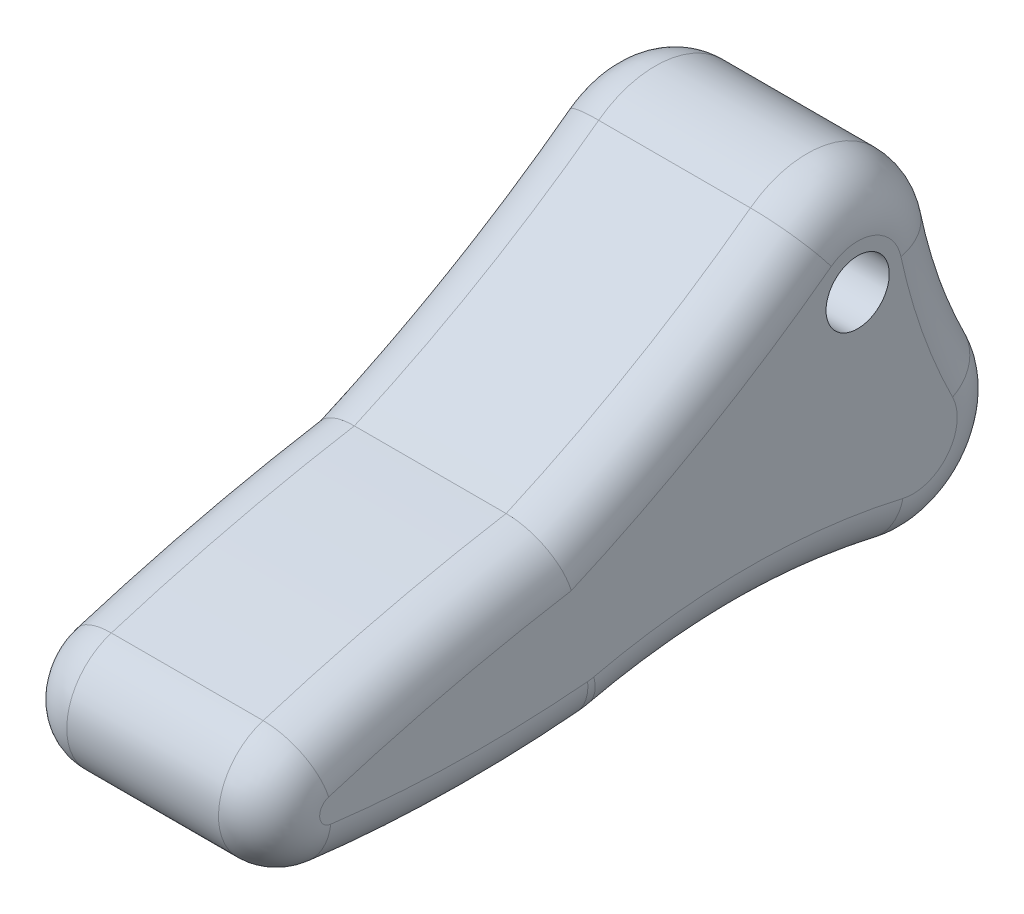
ISO-10303-21;
HEADER;
FILE_DESCRIPTION(('STEP AP214'),'2;1');
FILE_NAME('part.step','',(''),(''),'','','');
FILE_SCHEMA(('AUTOMOTIVE_DESIGN { 1 0 10303 214 1 1 1 1 }'));
ENDSEC;
DATA;
#1=APPLICATION_CONTEXT('core data for automotive mechanical design processes');
#2=APPLICATION_PROTOCOL_DEFINITION('international standard','automotive_design',2000,#1);
#3=PRODUCT_CONTEXT('',#1,'mechanical');
#4=PRODUCT('Part','Part','',(#3));
#5=PRODUCT_RELATED_PRODUCT_CATEGORY('part','',(#4));
#6=PRODUCT_DEFINITION_FORMATION('','',#4);
#7=PRODUCT_DEFINITION_CONTEXT('part definition',#1,'design');
#8=PRODUCT_DEFINITION('design','',#6,#7);
#9=PRODUCT_DEFINITION_SHAPE('','',#8);
#10=(LENGTH_UNIT() NAMED_UNIT(*) SI_UNIT(.MILLI.,.METRE.));
#11=(NAMED_UNIT(*) PLANE_ANGLE_UNIT() SI_UNIT($,.RADIAN.));
#12=(NAMED_UNIT(*) SI_UNIT($,.STERADIAN.) SOLID_ANGLE_UNIT());
#13=UNCERTAINTY_MEASURE_WITH_UNIT(LENGTH_MEASURE(1.E-05),#10,'distance_accuracy_value','');
#14=(GEOMETRIC_REPRESENTATION_CONTEXT(3) GLOBAL_UNCERTAINTY_ASSIGNED_CONTEXT((#13)) GLOBAL_UNIT_ASSIGNED_CONTEXT((#10,
#11,#12)) REPRESENTATION_CONTEXT('',''));
#15=CARTESIAN_POINT('',(0.,0.,0.));
#16=DIRECTION('',(0.,0.,1.));
#17=DIRECTION('',(1.,0.,0.));
#18=AXIS2_PLACEMENT_3D('',#15,#16,#17);
#19=CARTESIAN_POINT('',(50.8,437.978347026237,326.190400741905));
#20=DIRECTION('',(-1.,0.,0.));
#21=DIRECTION('',(0.,0.,1.));
#22=AXIS2_PLACEMENT_3D('',#19,#20,#21);
#23=CYLINDRICAL_SURFACE('',#22,508.);
#24=DIRECTION('',(-1.,0.,0.));
#25=VECTOR('',#24,1.);
#26=CARTESIAN_POINT('',(0.,-26.6889113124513,120.889794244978));
#27=LINE('',#26,#25);
#28=CARTESIAN_POINT('',(30.48,-26.6889113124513,120.889794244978));
#29=VERTEX_POINT('',#28);
#30=CARTESIAN_POINT('',(-30.48,-26.6889113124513,120.889794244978));
#31=VERTEX_POINT('',#30);
#32=EDGE_CURVE('E345',#29,#31,#27,.T.);
#33=ORIENTED_EDGE('',*,*,#32,.F.);
#34=CARTESIAN_POINT('',(30.48,437.978347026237,326.190400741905));
#35=DIRECTION('',(-1.,0.,0.));
#36=DIRECTION('',(0.,0.,1.));
#37=AXIS2_PLACEMENT_3D('',#34,#35,#36);
#38=CIRCLE('',#37,508.);
#39=CARTESIAN_POINT('',(30.48,30.5566288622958,22.7574698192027));
#40=VERTEX_POINT('',#39);
#41=EDGE_CURVE('E220',#29,#40,#38,.F.);
#42=ORIENTED_EDGE('',*,*,#41,.T.);
#43=DIRECTION('',(-1.,0.,0.));
#44=VECTOR('',#43,1.);
#45=CARTESIAN_POINT('',(50.8,30.5566288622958,22.7574698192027));
#46=LINE('',#45,#44);
#47=CARTESIAN_POINT('',(-30.48,30.5566288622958,22.7574698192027));
#48=VERTEX_POINT('',#47);
#49=EDGE_CURVE('E357',#40,#48,#46,.T.);
#50=ORIENTED_EDGE('',*,*,#49,.T.);
#51=CARTESIAN_POINT('',(-30.48,437.978347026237,326.190400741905));
#52=DIRECTION('',(-1.,0.,0.));
#53=DIRECTION('',(0.,0.,1.));
#54=AXIS2_PLACEMENT_3D('',#51,#52,#53);
#55=CIRCLE('',#54,508.);
#56=EDGE_CURVE('E218',#48,#31,#55,.T.);
#57=ORIENTED_EDGE('',*,*,#56,.T.);
#58=EDGE_LOOP('',(#33,#42,#50,#57));
#59=FACE_BOUND('',#58,.T.);
#60=ADVANCED_FACE('F31',(#59),#23,.F.);
#61=CARTESIAN_POINT('',(50.8,55.6115098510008,-260.837593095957));
#62=DIRECTION('',(-1.,0.,0.));
#63=DIRECTION('',(0.,0.,1.));
#64=AXIS2_PLACEMENT_3D('',#61,#62,#63);
#65=CYLINDRICAL_SURFACE('',#64,228.6);
#66=DIRECTION('',(-1.,0.,0.));
#67=VECTOR('',#66,1.);
#68=CARTESIAN_POINT('',(50.8,7.94450140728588,-37.2625132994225));
#69=LINE('',#68,#67);
#70=CARTESIAN_POINT('',(30.48,7.94450140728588,-37.2625132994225));
#71=VERTEX_POINT('',#70);
#72=CARTESIAN_POINT('',(-30.48,7.94450140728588,-37.2625132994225));
#73=VERTEX_POINT('',#72);
#74=EDGE_CURVE('E175',#71,#73,#69,.T.);
#75=ORIENTED_EDGE('',*,*,#74,.F.);
#76=CARTESIAN_POINT('',(30.48,55.6115098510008,-260.837593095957));
#77=DIRECTION('',(-1.,0.,0.));
#78=DIRECTION('',(0.,0.,1.));
#79=AXIS2_PLACEMENT_3D('',#76,#77,#78);
#80=CIRCLE('',#79,228.6);
#81=CARTESIAN_POINT('',(30.48,-46.4840700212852,-56.3028709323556));
#82=VERTEX_POINT('',#81);
#83=EDGE_CURVE('E191',#71,#82,#80,.F.);
#84=ORIENTED_EDGE('',*,*,#83,.T.);
#85=DIRECTION('',(-1.,0.,0.));
#86=VECTOR('',#85,1.);
#87=CARTESIAN_POINT('',(50.8,-46.4840700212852,-56.3028709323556));
#88=LINE('',#87,#86);
#89=CARTESIAN_POINT('',(-30.48,-46.4840700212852,-56.3028709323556));
#90=VERTEX_POINT('',#89);
#91=EDGE_CURVE('E348',#82,#90,#88,.T.);
#92=ORIENTED_EDGE('',*,*,#91,.T.);
#93=CARTESIAN_POINT('',(-30.48,55.6115098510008,-260.837593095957));
#94=DIRECTION('',(-1.,0.,0.));
#95=DIRECTION('',(0.,0.,1.));
#96=AXIS2_PLACEMENT_3D('',#93,#94,#95);
#97=CIRCLE('',#96,228.6);
#98=EDGE_CURVE('E189',#90,#73,#97,.T.);
#99=ORIENTED_EDGE('',*,*,#98,.T.);
#100=EDGE_LOOP('',(#75,#84,#92,#99));
#101=FACE_BOUND('',#100,.T.);
#102=ADVANCED_FACE('F33',(#101),#65,.F.);
#103=CARTESIAN_POINT('',(50.8,0.,0.));
#104=DIRECTION('',(-1.,0.,0.));
#105=DIRECTION('',(0.,0.,1.));
#106=AXIS2_PLACEMENT_3D('',#103,#104,#105);
#107=CYLINDRICAL_SURFACE('',#106,38.1000000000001);
#108=ORIENTED_EDGE('',*,*,#49,.F.);
#109=CARTESIAN_POINT('',(30.48,0.,0.));
#110=DIRECTION('',(-1.,0.,0.));
#111=DIRECTION('',(0.,0.,1.));
#112=AXIS2_PLACEMENT_3D('',#109,#110,#111);
#113=CIRCLE('',#112,38.1000000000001);
#114=EDGE_CURVE('E161',#40,#71,#113,.T.);
#115=ORIENTED_EDGE('',*,*,#114,.T.);
#116=ORIENTED_EDGE('',*,*,#74,.T.);
#117=CARTESIAN_POINT('',(-30.48,0.,0.));
#118=DIRECTION('',(-1.,0.,0.));
#119=DIRECTION('',(0.,0.,1.));
#120=AXIS2_PLACEMENT_3D('',#117,#118,#119);
#121=CIRCLE('',#120,38.1000000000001);
#122=EDGE_CURVE('E181',#73,#48,#121,.F.);
#123=ORIENTED_EDGE('',*,*,#122,.T.);
#124=EDGE_LOOP('',(#108,#115,#116,#123));
#125=FACE_BOUND('',#124,.T.);
#126=ADVANCED_FACE('F383',(#125),#107,.T.);
#127=CARTESIAN_POINT('',(50.8,-63.4999999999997,109.985226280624));
#128=DIRECTION('',(-1.,0.,0.));
#129=DIRECTION('',(0.,0.,1.));
#130=AXIS2_PLACEMENT_3D('',#127,#128,#129);
#131=CYLINDRICAL_SURFACE('',#130,38.1000000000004);
#132=DIRECTION('',(-1.,0.,0.));
#133=VECTOR('',#132,1.);
#134=CARTESIAN_POINT('',(50.8,-100.611679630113,101.363553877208));
#135=LINE('',#134,#133);
#136=CARTESIAN_POINT('',(30.48,-100.611679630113,101.363553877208));
#137=VERTEX_POINT('',#136);
#138=CARTESIAN_POINT('',(-30.48,-100.611679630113,101.363553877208));
#139=VERTEX_POINT('',#138);
#140=EDGE_CURVE('E354',#137,#139,#135,.T.);
#141=ORIENTED_EDGE('',*,*,#140,.F.);
#142=CARTESIAN_POINT('',(30.48,-63.4999999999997,109.985226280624));
#143=DIRECTION('',(-1.,0.,0.));
#144=DIRECTION('',(0.,0.,1.));
#145=AXIS2_PLACEMENT_3D('',#142,#143,#144);
#146=CIRCLE('',#145,38.1000000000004);
#147=CARTESIAN_POINT('',(30.48,-101.456661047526,106.683426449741));
#148=VERTEX_POINT('',#147);
#149=EDGE_CURVE('E203',#137,#148,#146,.T.);
#150=ORIENTED_EDGE('',*,*,#149,.T.);
#151=DIRECTION('',(-1.,0.,0.));
#152=VECTOR('',#151,1.);
#153=CARTESIAN_POINT('',(50.8,-101.456661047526,106.683426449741));
#154=LINE('',#153,#152);
#155=CARTESIAN_POINT('',(-30.48,-101.456661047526,106.683426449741));
#156=VERTEX_POINT('',#155);
#157=EDGE_CURVE('E336',#148,#156,#154,.T.);
#158=ORIENTED_EDGE('',*,*,#157,.T.);
#159=CARTESIAN_POINT('',(-30.48,-63.4999999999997,109.985226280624));
#160=DIRECTION('',(-1.,0.,0.));
#161=DIRECTION('',(0.,0.,1.));
#162=AXIS2_PLACEMENT_3D('',#159,#160,#161);
#163=CIRCLE('',#162,38.1000000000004);
#164=EDGE_CURVE('E201',#156,#139,#163,.F.);
#165=ORIENTED_EDGE('',*,*,#164,.T.);
#166=EDGE_LOOP('',(#141,#150,#158,#165));
#167=FACE_BOUND('',#166,.T.);
#168=ADVANCED_FACE('F428',(#167),#131,.T.);
#169=CARTESIAN_POINT('',(50.8,-348.022877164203,43.8857378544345));
#170=DIRECTION('',(-1.,0.,0.));
#171=DIRECTION('',(0.,0.,1.));
#172=AXIS2_PLACEMENT_3D('',#169,#170,#171);
#173=CYLINDRICAL_SURFACE('',#172,254.);
#174=DIRECTION('',(-1.,0.,0.));
#175=VECTOR('',#174,1.);
#176=CARTESIAN_POINT('',(50.8,-100.611679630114,-13.5920781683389));
#177=LINE('',#176,#175);
#178=CARTESIAN_POINT('',(30.48,-100.611679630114,-13.5920781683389));
#179=VERTEX_POINT('',#178);
#180=CARTESIAN_POINT('',(-30.48,-100.611679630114,-13.5920781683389));
#181=VERTEX_POINT('',#180);
#182=EDGE_CURVE('E351',#179,#181,#177,.T.);
#183=ORIENTED_EDGE('',*,*,#182,.F.);
#184=CARTESIAN_POINT('',(30.48,-348.022877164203,43.8857378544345));
#185=DIRECTION('',(-1.,0.,0.));
#186=DIRECTION('',(0.,0.,1.));
#187=AXIS2_PLACEMENT_3D('',#184,#185,#186);
#188=CIRCLE('',#187,254.);
#189=EDGE_CURVE('E199',#179,#137,#188,.F.);
#190=ORIENTED_EDGE('',*,*,#189,.T.);
#191=ORIENTED_EDGE('',*,*,#140,.T.);
#192=CARTESIAN_POINT('',(-30.48,-348.022877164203,43.8857378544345));
#193=DIRECTION('',(-1.,0.,0.));
#194=DIRECTION('',(0.,0.,1.));
#195=AXIS2_PLACEMENT_3D('',#192,#193,#194);
#196=CIRCLE('',#195,254.);
#197=EDGE_CURVE('E197',#139,#181,#196,.T.);
#198=ORIENTED_EDGE('',*,*,#197,.T.);
#199=EDGE_LOOP('',(#183,#190,#191,#198));
#200=FACE_BOUND('',#199,.T.);
#201=ADVANCED_FACE('F434',(#200),#173,.F.);
#202=CARTESIAN_POINT('',(50.8,-63.4999999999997,-22.213750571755));
#203=DIRECTION('',(-1.,0.,0.));
#204=DIRECTION('',(0.,0.,1.));
#205=AXIS2_PLACEMENT_3D('',#202,#203,#204);
#206=CYLINDRICAL_SURFACE('',#205,38.1000000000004);
#207=ORIENTED_EDGE('',*,*,#91,.F.);
#208=CARTESIAN_POINT('',(30.48,-63.4999999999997,-22.213750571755));
#209=DIRECTION('',(-1.,0.,0.));
#210=DIRECTION('',(0.,0.,1.));
#211=AXIS2_PLACEMENT_3D('',#208,#209,#210);
#212=CIRCLE('',#211,38.1000000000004);
#213=EDGE_CURVE('E195',#82,#179,#212,.T.);
#214=ORIENTED_EDGE('',*,*,#213,.T.);
#215=ORIENTED_EDGE('',*,*,#182,.T.);
#216=CARTESIAN_POINT('',(-30.48,-63.4999999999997,-22.213750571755));
#217=DIRECTION('',(-1.,0.,0.));
#218=DIRECTION('',(0.,0.,1.));
#219=AXIS2_PLACEMENT_3D('',#216,#217,#218);
#220=CIRCLE('',#219,38.1000000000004);
#221=EDGE_CURVE('E193',#181,#90,#220,.F.);
#222=ORIENTED_EDGE('',*,*,#221,.T.);
#223=EDGE_LOOP('',(#207,#214,#215,#222));
#224=FACE_BOUND('',#223,.T.);
#225=ADVANCED_FACE('F439',(#224),#206,.T.);
#226=CARTESIAN_POINT('',(50.8,27.8057549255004,-130.418796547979));
#227=DIRECTION('',(-1.,0.,0.));
#228=DIRECTION('',(0.,0.,1.));
#229=AXIS2_PLACEMENT_3D('',#226,#227,#228);
#230=PLANE('',#229);
#231=CARTESIAN_POINT('',(50.8,0.,0.));
#232=DIRECTION('',(-1.,0.,0.));
#233=DIRECTION('',(0.,0.,1.));
#234=AXIS2_PLACEMENT_3D('',#231,#232,#233);
#235=CIRCLE('',#234,12.7);
#236=CARTESIAN_POINT('',(50.8,0.,12.7));
#237=VERTEX_POINT('',#236);
#238=EDGE_CURVE('E262',#237,#237,#235,.T.);
#239=ORIENTED_EDGE('',*,*,#238,.T.);
#240=EDGE_LOOP('',(#239));
#241=FACE_BOUND('',#240,.T.);
#242=CARTESIAN_POINT('',(50.8,55.6115098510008,-260.837593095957));
#243=DIRECTION('',(-1.,0.,0.));
#244=DIRECTION('',(0.,0.,1.));
#245=AXIS2_PLACEMENT_3D('',#242,#243,#244);
#246=CIRCLE('',#245,248.92);
#247=CARTESIAN_POINT('',(50.8,-55.5592326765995,-38.1220067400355));
#248=VERTEX_POINT('',#247);
#249=CARTESIAN_POINT('',(50.8,3.70743399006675,-17.3891728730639));
#250=VERTEX_POINT('',#249);
#251=EDGE_CURVE('E179',#248,#250,#246,.T.);
#252=ORIENTED_EDGE('',*,*,#251,.T.);
#253=CARTESIAN_POINT('',(50.8,0.,0.));
#254=DIRECTION('',(-1.,0.,0.));
#255=DIRECTION('',(0.,0.,1.));
#256=AXIS2_PLACEMENT_3D('',#253,#254,#255);
#257=CIRCLE('',#256,17.7800000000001);
#258=CARTESIAN_POINT('',(50.8,14.2597601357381,10.6201525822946));
#259=VERTEX_POINT('',#258);
#260=EDGE_CURVE('E159',#250,#259,#257,.F.);
#261=ORIENTED_EDGE('',*,*,#260,.T.);
#262=CARTESIAN_POINT('',(50.8,437.978347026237,326.190400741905));
#263=DIRECTION('',(-1.,0.,0.));
#264=DIRECTION('',(0.,0.,1.));
#265=AXIS2_PLACEMENT_3D('',#262,#263,#264);
#266=CIRCLE('',#265,528.32);
#267=CARTESIAN_POINT('',(50.8,-46.3118292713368,115.038683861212));
#268=VERTEX_POINT('',#267);
#269=EDGE_CURVE('E168',#259,#268,#266,.T.);
#270=ORIENTED_EDGE('',*,*,#269,.T.);
#271=CARTESIAN_POINT('',(50.8,-778.00298948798,-6.27606569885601));
#272=DIRECTION('',(-1.,0.,0.));
#273=DIRECTION('',(0.,0.,1.));
#274=AXIS2_PLACEMENT_3D('',#271,#272,#273);
#275=CIRCLE('',#274,741.68);
#276=CARTESIAN_POINT('',(50.8,-69.3300909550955,212.520518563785));
#277=VERTEX_POINT('',#276);
#278=EDGE_CURVE('E174',#268,#277,#275,.F.);
#279=ORIENTED_EDGE('',*,*,#278,.T.);
#280=CARTESIAN_POINT('',(50.8,-74.1840149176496,211.02191182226));
#281=DIRECTION('',(-1.,0.,0.));
#282=DIRECTION('',(0.,0.,1.));
#283=AXIS2_PLACEMENT_3D('',#280,#281,#282);
#284=CIRCLE('',#283,5.08000000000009);
#285=CARTESIAN_POINT('',(50.8,-79.224185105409,211.656801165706));
#286=VERTEX_POINT('',#285);
#287=EDGE_CURVE('E363',#277,#286,#284,.F.);
#288=ORIENTED_EDGE('',*,*,#287,.T.);
#289=CARTESIAN_POINT('',(50.8,404.632152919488,150.707424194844));
#290=DIRECTION('',(-1.,0.,0.));
#291=DIRECTION('',(0.,0.,1.));
#292=AXIS2_PLACEMENT_3D('',#289,#290,#291);
#293=CIRCLE('',#292,487.68);
#294=CARTESIAN_POINT('',(50.8,-81.2131084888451,108.444386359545));
#295=VERTEX_POINT('',#294);
#296=EDGE_CURVE('E365',#286,#295,#293,.F.);
#297=ORIENTED_EDGE('',*,*,#296,.T.);
#298=CARTESIAN_POINT('',(50.8,-63.4999999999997,109.985226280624));
#299=DIRECTION('',(-1.,0.,0.));
#300=DIRECTION('',(0.,0.,1.));
#301=AXIS2_PLACEMENT_3D('',#298,#299,#300);
#302=CIRCLE('',#301,17.7800000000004);
#303=CARTESIAN_POINT('',(50.8,-80.8187838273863,105.96177915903));
#304=VERTEX_POINT('',#303);
#305=EDGE_CURVE('E367',#295,#304,#302,.F.);
#306=ORIENTED_EDGE('',*,*,#305,.T.);
#307=CARTESIAN_POINT('',(50.8,-348.022877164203,43.8857378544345));
#308=DIRECTION('',(-1.,0.,0.));
#309=DIRECTION('',(0.,0.,1.));
#310=AXIS2_PLACEMENT_3D('',#307,#308,#309);
#311=CIRCLE('',#310,274.32);
#312=CARTESIAN_POINT('',(50.8,-80.8187838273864,-18.1903034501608));
#313=VERTEX_POINT('',#312);
#314=EDGE_CURVE('E369',#304,#313,#311,.T.);
#315=ORIENTED_EDGE('',*,*,#314,.T.);
#316=CARTESIAN_POINT('',(50.8,-63.4999999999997,-22.213750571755));
#317=DIRECTION('',(-1.,0.,0.));
#318=DIRECTION('',(0.,0.,1.));
#319=AXIS2_PLACEMENT_3D('',#316,#317,#318);
#320=CIRCLE('',#319,17.7800000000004);
#321=EDGE_CURVE('E184',#313,#248,#320,.F.);
#322=ORIENTED_EDGE('',*,*,#321,.T.);
#323=EDGE_LOOP('',(#252,#261,#270,#279,#288,#297,#306,#315,#322));
#324=FACE_BOUND('',#323,.T.);
#325=ADVANCED_FACE('F177',(#241,#324),#230,.F.);
#326=CARTESIAN_POINT('',(-50.8,27.8057549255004,-130.418796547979));
#327=DIRECTION('',(-1.,0.,0.));
#328=DIRECTION('',(0.,0.,1.));
#329=AXIS2_PLACEMENT_3D('',#326,#327,#328);
#330=PLANE('',#329);
#331=CARTESIAN_POINT('',(-50.8,0.,0.));
#332=DIRECTION('',(-1.,0.,0.));
#333=DIRECTION('',(0.,0.,1.));
#334=AXIS2_PLACEMENT_3D('',#331,#332,#333);
#335=CIRCLE('',#334,12.7);
#336=CARTESIAN_POINT('',(-50.8,0.,12.7));
#337=VERTEX_POINT('',#336);
#338=EDGE_CURVE('E266',#337,#337,#335,.T.);
#339=ORIENTED_EDGE('',*,*,#338,.F.);
#340=EDGE_LOOP('',(#339));
#341=FACE_BOUND('',#340,.T.);
#342=CARTESIAN_POINT('',(-50.8,404.632152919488,150.707424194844));
#343=DIRECTION('',(-1.,0.,0.));
#344=DIRECTION('',(0.,0.,1.));
#345=AXIS2_PLACEMENT_3D('',#342,#343,#344);
#346=CIRCLE('',#345,487.68);
#347=CARTESIAN_POINT('',(-50.8,-81.2131084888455,108.444386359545));
#348=VERTEX_POINT('',#347);
#349=CARTESIAN_POINT('',(-50.8,-79.2241851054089,211.656801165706));
#350=VERTEX_POINT('',#349);
#351=EDGE_CURVE('E39',#348,#350,#346,.T.);
#352=ORIENTED_EDGE('',*,*,#351,.T.);
#353=CARTESIAN_POINT('',(-50.8,-74.1840149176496,211.02191182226));
#354=DIRECTION('',(-1.,0.,0.));
#355=DIRECTION('',(0.,0.,1.));
#356=AXIS2_PLACEMENT_3D('',#353,#354,#355);
#357=CIRCLE('',#356,5.08000000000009);
#358=CARTESIAN_POINT('',(-50.8,-69.3300909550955,212.520518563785));
#359=VERTEX_POINT('',#358);
#360=EDGE_CURVE('E11',#350,#359,#357,.T.);
#361=ORIENTED_EDGE('',*,*,#360,.T.);
#362=CARTESIAN_POINT('',(-50.8,-778.00298948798,-6.27606569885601));
#363=DIRECTION('',(-1.,0.,0.));
#364=DIRECTION('',(0.,0.,1.));
#365=AXIS2_PLACEMENT_3D('',#362,#363,#364);
#366=CIRCLE('',#365,741.68);
#367=CARTESIAN_POINT('',(-50.8,-46.3118292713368,115.038683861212));
#368=VERTEX_POINT('',#367);
#369=EDGE_CURVE('E222',#359,#368,#366,.T.);
#370=ORIENTED_EDGE('',*,*,#369,.T.);
#371=CARTESIAN_POINT('',(-50.8,437.978347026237,326.190400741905));
#372=DIRECTION('',(-1.,0.,0.));
#373=DIRECTION('',(0.,0.,1.));
#374=AXIS2_PLACEMENT_3D('',#371,#372,#373);
#375=CIRCLE('',#374,528.32);
#376=CARTESIAN_POINT('',(-50.8,14.2597601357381,10.6201525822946));
#377=VERTEX_POINT('',#376);
#378=EDGE_CURVE('E224',#368,#377,#375,.F.);
#379=ORIENTED_EDGE('',*,*,#378,.T.);
#380=CARTESIAN_POINT('',(-50.8,0.,0.));
#381=DIRECTION('',(-1.,0.,0.));
#382=DIRECTION('',(0.,0.,1.));
#383=AXIS2_PLACEMENT_3D('',#380,#381,#382);
#384=CIRCLE('',#383,17.7800000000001);
#385=CARTESIAN_POINT('',(-50.8,3.70743399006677,-17.3891728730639));
#386=VERTEX_POINT('',#385);
#387=EDGE_CURVE('E226',#377,#386,#384,.T.);
#388=ORIENTED_EDGE('',*,*,#387,.T.);
#389=CARTESIAN_POINT('',(-50.8,55.6115098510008,-260.837593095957));
#390=DIRECTION('',(-1.,0.,0.));
#391=DIRECTION('',(0.,0.,1.));
#392=AXIS2_PLACEMENT_3D('',#389,#390,#391);
#393=CIRCLE('',#392,248.92);
#394=CARTESIAN_POINT('',(-50.8,-55.5592326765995,-38.1220067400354));
#395=VERTEX_POINT('',#394);
#396=EDGE_CURVE('E228',#386,#395,#393,.F.);
#397=ORIENTED_EDGE('',*,*,#396,.T.);
#398=CARTESIAN_POINT('',(-50.8,-63.4999999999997,-22.213750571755));
#399=DIRECTION('',(-1.,0.,0.));
#400=DIRECTION('',(0.,0.,1.));
#401=AXIS2_PLACEMENT_3D('',#398,#399,#400);
#402=CIRCLE('',#401,17.7800000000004);
#403=CARTESIAN_POINT('',(-50.8,-80.8187838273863,-18.1903034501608));
#404=VERTEX_POINT('',#403);
#405=EDGE_CURVE('E230',#395,#404,#402,.T.);
#406=ORIENTED_EDGE('',*,*,#405,.T.);
#407=CARTESIAN_POINT('',(-50.8,-348.022877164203,43.8857378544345));
#408=DIRECTION('',(-1.,0.,0.));
#409=DIRECTION('',(0.,0.,1.));
#410=AXIS2_PLACEMENT_3D('',#407,#408,#409);
#411=CIRCLE('',#410,274.32);
#412=CARTESIAN_POINT('',(-50.8,-80.8187838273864,105.96177915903));
#413=VERTEX_POINT('',#412);
#414=EDGE_CURVE('E232',#404,#413,#411,.F.);
#415=ORIENTED_EDGE('',*,*,#414,.T.);
#416=CARTESIAN_POINT('',(-50.8,-63.4999999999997,109.985226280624));
#417=DIRECTION('',(-1.,0.,0.));
#418=DIRECTION('',(0.,0.,1.));
#419=AXIS2_PLACEMENT_3D('',#416,#417,#418);
#420=CIRCLE('',#419,17.7800000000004);
#421=EDGE_CURVE('E49',#413,#348,#420,.T.);
#422=ORIENTED_EDGE('',*,*,#421,.T.);
#423=EDGE_LOOP('',(#352,#361,#370,#379,#388,#397,#406,#415,#422));
#424=FACE_BOUND('',#423,.T.);
#425=ADVANCED_FACE('F236',(#341,#424),#330,.T.);
#426=CARTESIAN_POINT('',(50.8,-778.00298948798,-6.27606569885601));
#427=DIRECTION('',(-1.,0.,0.));
#428=DIRECTION('',(0.,0.,1.));
#429=AXIS2_PLACEMENT_3D('',#426,#427,#428);
#430=CYLINDRICAL_SURFACE('',#429,762.);
#431=DIRECTION('',(-1.,0.,0.));
#432=VECTOR('',#431,1.);
#433=CARTESIAN_POINT('',(50.8,-49.9143951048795,218.514945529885));
#434=LINE('',#433,#432);
#435=CARTESIAN_POINT('',(30.48,-49.9143951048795,218.514945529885));
#436=VERTEX_POINT('',#435);
#437=CARTESIAN_POINT('',(-30.48,-49.9143951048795,218.514945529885));
#438=VERTEX_POINT('',#437);
#439=EDGE_CURVE('E342',#436,#438,#434,.T.);
#440=ORIENTED_EDGE('',*,*,#439,.F.);
#441=CARTESIAN_POINT('',(30.48,-778.00298948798,-6.27606569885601));
#442=DIRECTION('',(-1.,0.,0.));
#443=DIRECTION('',(0.,0.,1.));
#444=AXIS2_PLACEMENT_3D('',#441,#442,#443);
#445=CIRCLE('',#444,762.);
#446=EDGE_CURVE('E216',#436,#29,#445,.T.);
#447=ORIENTED_EDGE('',*,*,#446,.T.);
#448=ORIENTED_EDGE('',*,*,#32,.T.);
#449=CARTESIAN_POINT('',(-30.48,-778.00298948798,-6.27606569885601));
#450=DIRECTION('',(-1.,0.,0.));
#451=DIRECTION('',(0.,0.,1.));
#452=AXIS2_PLACEMENT_3D('',#449,#450,#451);
#453=CIRCLE('',#452,762.);
#454=EDGE_CURVE('E214',#31,#438,#453,.F.);
#455=ORIENTED_EDGE('',*,*,#454,.T.);
#456=EDGE_LOOP('',(#440,#447,#448,#455));
#457=FACE_BOUND('',#456,.T.);
#458=ADVANCED_FACE('F409',(#457),#430,.T.);
#459=CARTESIAN_POINT('',(50.8,-74.1840149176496,211.02191182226));
#460=DIRECTION('',(-1.,0.,0.));
#461=DIRECTION('',(0.,0.,1.));
#462=AXIS2_PLACEMENT_3D('',#459,#460,#461);
#463=CYLINDRICAL_SURFACE('',#462,25.4000000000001);
#464=DIRECTION('',(-1.,0.,0.));
#465=VECTOR('',#464,1.);
#466=CARTESIAN_POINT('',(50.8,-99.3848658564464,214.196358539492));
#467=LINE('',#466,#465);
#468=CARTESIAN_POINT('',(30.48,-99.3848658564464,214.196358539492));
#469=VERTEX_POINT('',#468);
#470=CARTESIAN_POINT('',(-30.48,-99.3848658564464,214.196358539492));
#471=VERTEX_POINT('',#470);
#472=EDGE_CURVE('E339',#469,#471,#467,.T.);
#473=ORIENTED_EDGE('',*,*,#472,.F.);
#474=CARTESIAN_POINT('',(30.48,-74.1840149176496,211.02191182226));
#475=DIRECTION('',(-1.,0.,0.));
#476=DIRECTION('',(0.,0.,1.));
#477=AXIS2_PLACEMENT_3D('',#474,#475,#476);
#478=CIRCLE('',#477,25.4000000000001);
#479=EDGE_CURVE('E212',#469,#436,#478,.T.);
#480=ORIENTED_EDGE('',*,*,#479,.T.);
#481=ORIENTED_EDGE('',*,*,#439,.T.);
#482=CARTESIAN_POINT('',(-30.48,-74.1840149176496,211.02191182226));
#483=DIRECTION('',(-1.,0.,0.));
#484=DIRECTION('',(0.,0.,1.));
#485=AXIS2_PLACEMENT_3D('',#482,#483,#484);
#486=CIRCLE('',#485,25.4000000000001);
#487=EDGE_CURVE('E209',#438,#471,#486,.F.);
#488=ORIENTED_EDGE('',*,*,#487,.T.);
#489=EDGE_LOOP('',(#473,#480,#481,#488));
#490=FACE_BOUND('',#489,.T.);
#491=ADVANCED_FACE('F414',(#490),#463,.T.);
#492=CARTESIAN_POINT('',(50.8,404.632152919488,150.707424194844));
#493=DIRECTION('',(-1.,0.,0.));
#494=DIRECTION('',(0.,0.,1.));
#495=AXIS2_PLACEMENT_3D('',#492,#493,#494);
#496=CYLINDRICAL_SURFACE('',#495,508.);
#497=ORIENTED_EDGE('',*,*,#157,.F.);
#498=CARTESIAN_POINT('',(30.48,404.632152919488,150.707424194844));
#499=DIRECTION('',(-1.,0.,0.));
#500=DIRECTION('',(0.,0.,1.));
#501=AXIS2_PLACEMENT_3D('',#498,#499,#500);
#502=CIRCLE('',#501,508.);
#503=EDGE_CURVE('E207',#148,#469,#502,.T.);
#504=ORIENTED_EDGE('',*,*,#503,.T.);
#505=ORIENTED_EDGE('',*,*,#472,.T.);
#506=CARTESIAN_POINT('',(-30.48,404.632152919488,150.707424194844));
#507=DIRECTION('',(-1.,0.,0.));
#508=DIRECTION('',(0.,0.,1.));
#509=AXIS2_PLACEMENT_3D('',#506,#507,#508);
#510=CIRCLE('',#509,508.);
#511=EDGE_CURVE('E205',#471,#156,#510,.F.);
#512=ORIENTED_EDGE('',*,*,#511,.T.);
#513=EDGE_LOOP('',(#497,#504,#505,#512));
#514=FACE_BOUND('',#513,.T.);
#515=ADVANCED_FACE('F470',(#514),#496,.T.);
#516=CARTESIAN_POINT('',(30.48,-63.4999999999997,109.985226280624));
#517=DIRECTION('',(-1.,0.,0.));
#518=DIRECTION('',(0.,0.,1.));
#519=AXIS2_PLACEMENT_3D('',#516,#517,#518);
#520=DEGENERATE_TOROIDAL_SURFACE('',#519,17.7800000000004,20.32,.T.);
#521=CARTESIAN_POINT('',(30.48,-80.8187838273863,105.96177915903));
#522=DIRECTION('',(0.,0.226290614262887,-0.974059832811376));
#523=DIRECTION('',(0.,0.974059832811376,0.226290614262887));
#524=AXIS2_PLACEMENT_3D('',#521,#522,#523);
#525=CIRCLE('',#524,20.32);
#526=EDGE_CURVE('E330',#304,#137,#525,.T.);
#527=ORIENTED_EDGE('',*,*,#526,.F.);
#528=ORIENTED_EDGE('',*,*,#305,.F.);
#529=CARTESIAN_POINT('',(30.48,-81.2131084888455,108.444386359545));
#530=DIRECTION('',(0.,-0.0866614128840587,0.996237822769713));
#531=DIRECTION('',(0.,-0.996237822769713,-0.0866614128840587));
#532=AXIS2_PLACEMENT_3D('',#529,#530,#531);
#533=CIRCLE('',#532,20.32);
#534=EDGE_CURVE('E333',#148,#295,#533,.T.);
#535=ORIENTED_EDGE('',*,*,#534,.F.);
#536=ORIENTED_EDGE('',*,*,#149,.F.);
#537=EDGE_LOOP('',(#527,#528,#535,#536));
#538=FACE_BOUND('',#537,.T.);
#539=ADVANCED_FACE('F447',(#538),#520,.T.);
#540=CARTESIAN_POINT('',(30.48,404.632152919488,150.707424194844));
#541=DIRECTION('',(-1.,0.,0.));
#542=DIRECTION('',(0.,0.,1.));
#543=AXIS2_PLACEMENT_3D('',#540,#541,#542);
#544=TOROIDAL_SURFACE('',#543,487.68,20.32);
#545=ORIENTED_EDGE('',*,*,#534,.T.);
#546=ORIENTED_EDGE('',*,*,#296,.F.);
#547=CARTESIAN_POINT('',(30.48,-79.2241851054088,211.656801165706));
#548=DIRECTION('',(0.,0.124978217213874,0.992159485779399));
#549=DIRECTION('',(0.,-0.992159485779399,0.124978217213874));
#550=AXIS2_PLACEMENT_3D('',#547,#548,#549);
#551=CIRCLE('',#550,20.32);
#552=EDGE_CURVE('E327',#469,#286,#551,.T.);
#553=ORIENTED_EDGE('',*,*,#552,.F.);
#554=ORIENTED_EDGE('',*,*,#503,.F.);
#555=EDGE_LOOP('',(#545,#546,#553,#554));
#556=FACE_BOUND('',#555,.T.);
#557=ADVANCED_FACE('F476',(#556),#544,.T.);
#558=CARTESIAN_POINT('',(30.48,-348.022877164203,43.8857378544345));
#559=DIRECTION('',(-1.,0.,0.));
#560=DIRECTION('',(0.,0.,1.));
#561=AXIS2_PLACEMENT_3D('',#558,#559,#560);
#562=TOROIDAL_SURFACE('',#561,274.32,20.32);
#563=ORIENTED_EDGE('',*,*,#526,.T.);
#564=ORIENTED_EDGE('',*,*,#189,.F.);
#565=CARTESIAN_POINT('',(30.48,-80.8187838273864,-18.1903034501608));
#566=DIRECTION('',(0.,-0.226290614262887,-0.974059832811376));
#567=DIRECTION('',(0.,0.974059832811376,-0.226290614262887));
#568=AXIS2_PLACEMENT_3D('',#565,#566,#567);
#569=CIRCLE('',#568,20.32);
#570=EDGE_CURVE('E324',#313,#179,#569,.T.);
#571=ORIENTED_EDGE('',*,*,#570,.F.);
#572=ORIENTED_EDGE('',*,*,#314,.F.);
#573=EDGE_LOOP('',(#563,#564,#571,#572));
#574=FACE_BOUND('',#573,.T.);
#575=ADVANCED_FACE('F452',(#574),#562,.T.);
#576=CARTESIAN_POINT('',(30.48,-74.1840149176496,211.02191182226));
#577=DIRECTION('',(-1.,0.,0.));
#578=DIRECTION('',(0.,0.,1.));
#579=AXIS2_PLACEMENT_3D('',#576,#577,#578);
#580=DEGENERATE_TOROIDAL_SURFACE('',#579,5.08000000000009,20.32,.T.);
#581=ORIENTED_EDGE('',*,*,#552,.T.);
#582=ORIENTED_EDGE('',*,*,#287,.F.);
#583=CARTESIAN_POINT('',(30.48,-69.3300909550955,212.520518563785));
#584=DIRECTION('',(0.,0.295001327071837,-0.955496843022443));
#585=DIRECTION('',(0.,0.955496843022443,0.295001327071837));
#586=AXIS2_PLACEMENT_3D('',#583,#584,#585);
#587=CIRCLE('',#586,20.32);
#588=EDGE_CURVE('E321',#436,#277,#587,.T.);
#589=ORIENTED_EDGE('',*,*,#588,.F.);
#590=ORIENTED_EDGE('',*,*,#479,.F.);
#591=EDGE_LOOP('',(#581,#582,#589,#590));
#592=FACE_BOUND('',#591,.T.);
#593=ADVANCED_FACE('F418',(#592),#580,.T.);
#594=CARTESIAN_POINT('',(30.48,-63.4999999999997,-22.213750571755));
#595=DIRECTION('',(-1.,0.,0.));
#596=DIRECTION('',(0.,0.,1.));
#597=AXIS2_PLACEMENT_3D('',#594,#595,#596);
#598=DEGENERATE_TOROIDAL_SURFACE('',#597,17.7800000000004,20.32,.T.);
#599=ORIENTED_EDGE('',*,*,#570,.T.);
#600=ORIENTED_EDGE('',*,*,#213,.F.);
#601=CARTESIAN_POINT('',(30.48,-55.5592326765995,-38.1220067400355));
#602=DIRECTION('',(0.,0.894727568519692,0.446612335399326));
#603=DIRECTION('',(0.,-0.446612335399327,0.894727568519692));
#604=AXIS2_PLACEMENT_3D('',#601,#602,#603);
#605=CIRCLE('',#604,20.32);
#606=EDGE_CURVE('E318',#248,#82,#605,.T.);
#607=ORIENTED_EDGE('',*,*,#606,.F.);
#608=ORIENTED_EDGE('',*,*,#321,.F.);
#609=EDGE_LOOP('',(#599,#600,#607,#608));
#610=FACE_BOUND('',#609,.T.);
#611=ADVANCED_FACE('F308',(#610),#598,.T.);
#612=CARTESIAN_POINT('',(30.48,-778.00298948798,-6.27606569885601));
#613=DIRECTION('',(-1.,0.,0.));
#614=DIRECTION('',(0.,0.,1.));
#615=AXIS2_PLACEMENT_3D('',#612,#613,#614);
#616=TOROIDAL_SURFACE('',#615,741.68,20.32);
#617=ORIENTED_EDGE('',*,*,#588,.T.);
#618=ORIENTED_EDGE('',*,*,#278,.F.);
#619=CARTESIAN_POINT('',(30.48,-26.6889113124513,120.889794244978));
#620=CARTESIAN_POINT('',(30.7641784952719,-26.6889108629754,120.889794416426));
#621=CARTESIAN_POINT('',(31.0483252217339,-26.6946656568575,120.88806546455));
#622=CARTESIAN_POINT('',(31.6161040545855,-26.7176680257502,120.881154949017));
#623=CARTESIAN_POINT('',(31.899736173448,-26.7349153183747,120.875973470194));
#624=CARTESIAN_POINT('',(32.7490495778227,-26.8038571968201,120.855262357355));
#625=CARTESIAN_POINT('',(33.313304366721,-26.8727518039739,120.834566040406));
#626=CARTESIAN_POINT('',(34.4332144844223,-27.0558359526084,120.779573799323));
#627=CARTESIAN_POINT('',(34.9888771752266,-27.1699841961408,120.745290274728));
#628=CARTESIAN_POINT('',(35.813202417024,-27.3744781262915,120.68388345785));
#629=CARTESIAN_POINT('',(36.086460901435,-27.4481919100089,120.661749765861));
#630=CARTESIAN_POINT('',(36.6295625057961,-27.6065991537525,120.614190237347));
#631=CARTESIAN_POINT('',(36.8994047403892,-27.6912953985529,120.588763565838));
#632=CARTESIAN_POINT('',(37.7030962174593,-27.961650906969,120.507609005));
#633=CARTESIAN_POINT('',(38.2310837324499,-28.1635703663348,120.447008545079));
#634=CARTESIAN_POINT('',(39.2674564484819,-28.609237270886,120.313291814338));
#635=CARTESIAN_POINT('',(39.7758415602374,-28.8529849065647,120.240175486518));
#636=CARTESIAN_POINT('',(40.5209379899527,-29.2485537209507,120.12155671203));
#637=CARTESIAN_POINT('',(40.7664108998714,-29.3854146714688,120.080522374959));
#638=CARTESIAN_POINT('',(41.2510820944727,-29.6688486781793,119.995556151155));
#639=CARTESIAN_POINT('',(41.4902819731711,-29.8154192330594,119.951625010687));
#640=CARTESIAN_POINT('',(42.1979765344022,-30.2693889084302,119.815582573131));
#641=CARTESIAN_POINT('',(42.6566131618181,-30.5910710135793,119.71921476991));
#642=CARTESIAN_POINT('',(43.5456301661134,-31.2711819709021,119.51555486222));
#643=CARTESIAN_POINT('',(43.9759102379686,-31.6297308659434,119.408227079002));
#644=CARTESIAN_POINT('',(44.8036178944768,-32.3801170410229,119.183708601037));
#645=CARTESIAN_POINT('',(45.201045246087,-32.7719545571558,119.066517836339));
#646=CARTESIAN_POINT('',(45.9604699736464,-33.5862974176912,118.823082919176));
#647=CARTESIAN_POINT('',(46.322456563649,-34.0088120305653,118.696836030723));
#648=CARTESIAN_POINT('',(46.8367865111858,-34.6630693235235,118.501446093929));
#649=CARTESIAN_POINT('',(47.0034608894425,-34.884578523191,118.43531010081));
#650=CARTESIAN_POINT('',(47.3270645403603,-35.3341329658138,118.301121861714));
#651=CARTESIAN_POINT('',(47.4839913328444,-35.5621798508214,118.233069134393));
#652=CARTESIAN_POINT('',(47.9418894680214,-36.258819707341,118.025237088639));
#653=CARTESIAN_POINT('',(48.2275255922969,-36.7367923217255,117.882715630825));
#654=CARTESIAN_POINT('',(48.7559849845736,-37.7140420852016,117.591487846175));
#655=CARTESIAN_POINT('',(48.9988081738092,-38.2133192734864,117.442781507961));
#656=CARTESIAN_POINT('',(49.3296398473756,-38.9753562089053,117.21594897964));
#657=CARTESIAN_POINT('',(49.4343435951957,-39.2315365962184,117.139714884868));
#658=CARTESIAN_POINT('',(49.6324583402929,-39.7478150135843,116.986126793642));
#659=CARTESIAN_POINT('',(49.7258720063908,-40.0079121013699,116.908773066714));
#660=CARTESIAN_POINT('',(49.9889393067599,-40.7934277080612,116.675229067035));
#661=CARTESIAN_POINT('',(50.1414998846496,-41.3242564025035,116.517500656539));
#662=CARTESIAN_POINT('',(50.3575377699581,-42.2205529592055,116.251344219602));
#663=CARTESIAN_POINT('',(50.4338269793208,-42.5832452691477,116.143686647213));
#664=CARTESIAN_POINT('',(50.5650643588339,-43.3121957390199,115.927404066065));
#665=CARTESIAN_POINT('',(50.6200140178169,-43.6784536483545,115.818779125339));
#666=CARTESIAN_POINT('',(50.7083298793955,-44.4127670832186,115.601088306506));
#667=CARTESIAN_POINT('',(50.741730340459,-44.7808188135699,115.492023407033));
#668=CARTESIAN_POINT('',(50.7869837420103,-45.5181009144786,115.27363697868));
#669=CARTESIAN_POINT('',(50.7988428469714,-45.8873309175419,115.164315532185));
#670=CARTESIAN_POINT('',(50.7999731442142,-46.2749600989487,115.049595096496));
#671=CARTESIAN_POINT('',(50.8000000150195,-46.2933947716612,115.044139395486));
#672=CARTESIAN_POINT('',(50.8,-46.311829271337,115.038683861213));
#673=B_SPLINE_CURVE_WITH_KNOTS('',3,(#619,#620,#621,#622,#623,#624,#625,#626,#627,#628,#629,
#630,#631,#632,#633,#634,#635,#636,#637,#638,#639,#640,#641,#642,#643,#644,#645,#646,#647,#648,
#649,#650,#651,#652,#653,#654,#655,#656,#657,#658,#659,#660,#661,#662,#663,#664,#665,#666,#667,
#668,#669,#670,#671,#672),.UNSPECIFIED.,.F.,.F.,(4,2,2,2,2,2,2,2,2,2,2,2,2,2,2,2,2,2,2,2,2,2,2,
2,2,2,4),(0.,0.85240856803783,1.70479619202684,3.40910360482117,5.11185925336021,
5.96331019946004,6.81497746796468,8.51839386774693,10.2218180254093,11.0736810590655,
11.9253254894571,13.6284535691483,15.3373142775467,17.04618710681,18.7555784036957,
19.6103419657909,20.4653221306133,22.1874724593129,23.9096259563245,24.7705796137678,
25.6313293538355,27.3522007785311,28.5095195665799,29.666757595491,30.8221513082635,
31.9772143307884,32.034889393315),.UNSPECIFIED.);
#674=EDGE_CURVE('E171',#29,#268,#673,.T.);
#675=ORIENTED_EDGE('',*,*,#674,.F.);
#676=ORIENTED_EDGE('',*,*,#446,.F.);
#677=EDGE_LOOP('',(#617,#618,#675,#676));
#678=FACE_BOUND('',#677,.T.);
#679=ADVANCED_FACE('F303',(#678),#616,.T.);
#680=CARTESIAN_POINT('',(30.48,55.6115098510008,-260.837593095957));
#681=DIRECTION('',(-1.,0.,0.));
#682=DIRECTION('',(0.,0.,1.));
#683=AXIS2_PLACEMENT_3D('',#680,#681,#682);
#684=TOROIDAL_SURFACE('',#683,248.92,20.32);
#685=ORIENTED_EDGE('',*,*,#606,.T.);
#686=ORIENTED_EDGE('',*,*,#83,.F.);
#687=CARTESIAN_POINT('',(30.48,3.70743399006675,-17.3891728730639));
#688=DIRECTION('',(0.,0.978018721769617,0.208517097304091));
#689=DIRECTION('',(0.,-0.208517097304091,0.978018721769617));
#690=AXIS2_PLACEMENT_3D('',#687,#688,#689);
#691=CIRCLE('',#690,20.32);
#692=EDGE_CURVE('E164',#250,#71,#691,.T.);
#693=ORIENTED_EDGE('',*,*,#692,.F.);
#694=ORIENTED_EDGE('',*,*,#251,.F.);
#695=EDGE_LOOP('',(#685,#686,#693,#694));
#696=FACE_BOUND('',#695,.T.);
#697=ADVANCED_FACE('F307',(#696),#684,.T.);
#698=CARTESIAN_POINT('',(30.48,437.978347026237,326.190400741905));
#699=DIRECTION('',(-1.,0.,0.));
#700=DIRECTION('',(0.,0.,1.));
#701=AXIS2_PLACEMENT_3D('',#698,#699,#700);
#702=TOROIDAL_SURFACE('',#701,528.32,20.32);
#703=ORIENTED_EDGE('',*,*,#674,.T.);
#704=ORIENTED_EDGE('',*,*,#269,.F.);
#705=CARTESIAN_POINT('',(30.48,14.2597601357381,10.6201525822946));
#706=DIRECTION('',(0.,0.597308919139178,-0.802011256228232));
#707=DIRECTION('',(0.,0.802011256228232,0.597308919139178));
#708=AXIS2_PLACEMENT_3D('',#705,#706,#707);
#709=CIRCLE('',#708,20.32);
#710=EDGE_CURVE('E155',#40,#259,#709,.T.);
#711=ORIENTED_EDGE('',*,*,#710,.F.);
#712=ORIENTED_EDGE('',*,*,#41,.F.);
#713=EDGE_LOOP('',(#703,#704,#711,#712));
#714=FACE_BOUND('',#713,.T.);
#715=ADVANCED_FACE('F169',(#714),#702,.T.);
#716=CARTESIAN_POINT('',(30.48,0.,0.));
#717=DIRECTION('',(-1.,0.,0.));
#718=DIRECTION('',(0.,0.,1.));
#719=AXIS2_PLACEMENT_3D('',#716,#717,#718);
#720=DEGENERATE_TOROIDAL_SURFACE('',#719,17.7800000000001,20.32,.T.);
#721=ORIENTED_EDGE('',*,*,#692,.T.);
#722=ORIENTED_EDGE('',*,*,#114,.F.);
#723=ORIENTED_EDGE('',*,*,#710,.T.);
#724=ORIENTED_EDGE('',*,*,#260,.F.);
#725=EDGE_LOOP('',(#721,#722,#723,#724));
#726=FACE_BOUND('',#725,.T.);
#727=ADVANCED_FACE('F157',(#726),#720,.T.);
#728=CARTESIAN_POINT('',(-30.48,55.6115098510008,-260.837593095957));
#729=DIRECTION('',(-1.,0.,0.));
#730=DIRECTION('',(0.,0.,1.));
#731=AXIS2_PLACEMENT_3D('',#728,#729,#730);
#732=TOROIDAL_SURFACE('',#731,248.92,20.32);
#733=CARTESIAN_POINT('',(-30.48,3.70743399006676,-17.3891728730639));
#734=DIRECTION('',(0.,0.978018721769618,0.20851709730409));
#735=DIRECTION('',(0.,-0.20851709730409,0.978018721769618));
#736=AXIS2_PLACEMENT_3D('',#733,#734,#735);
#737=CIRCLE('',#736,20.32);
#738=EDGE_CURVE('E390',#73,#386,#737,.T.);
#739=ORIENTED_EDGE('',*,*,#738,.F.);
#740=ORIENTED_EDGE('',*,*,#98,.F.);
#741=CARTESIAN_POINT('',(-30.48,-55.5592326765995,-38.1220067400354));
#742=DIRECTION('',(0.,-0.894727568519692,-0.446612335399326));
#743=DIRECTION('',(0.,0.446612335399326,-0.894727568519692));
#744=AXIS2_PLACEMENT_3D('',#741,#742,#743);
#745=CIRCLE('',#744,20.32);
#746=EDGE_CURVE('E165',#395,#90,#745,.T.);
#747=ORIENTED_EDGE('',*,*,#746,.F.);
#748=ORIENTED_EDGE('',*,*,#396,.F.);
#749=EDGE_LOOP('',(#739,#740,#747,#748));
#750=FACE_BOUND('',#749,.T.);
#751=ADVANCED_FACE('F296',(#750),#732,.T.);
#752=CARTESIAN_POINT('',(-30.48,-63.4999999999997,-22.213750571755));
#753=DIRECTION('',(-1.,0.,0.));
#754=DIRECTION('',(0.,0.,1.));
#755=AXIS2_PLACEMENT_3D('',#752,#753,#754);
#756=DEGENERATE_TOROIDAL_SURFACE('',#755,17.7800000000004,20.32,.T.);
#757=ORIENTED_EDGE('',*,*,#746,.T.);
#758=ORIENTED_EDGE('',*,*,#221,.F.);
#759=CARTESIAN_POINT('',(-30.48,-80.8187838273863,-18.1903034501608));
#760=DIRECTION('',(0.,0.226290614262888,0.974059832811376));
#761=DIRECTION('',(0.,-0.974059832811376,0.226290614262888));
#762=AXIS2_PLACEMENT_3D('',#759,#760,#761);
#763=CIRCLE('',#762,20.32);
#764=EDGE_CURVE('E394',#404,#181,#763,.T.);
#765=ORIENTED_EDGE('',*,*,#764,.F.);
#766=ORIENTED_EDGE('',*,*,#405,.F.);
#767=EDGE_LOOP('',(#757,#758,#765,#766));
#768=FACE_BOUND('',#767,.T.);
#769=ADVANCED_FACE('F292',(#768),#756,.T.);
#770=CARTESIAN_POINT('',(-30.48,0.,0.));
#771=DIRECTION('',(-1.,0.,0.));
#772=DIRECTION('',(0.,0.,1.));
#773=AXIS2_PLACEMENT_3D('',#770,#771,#772);
#774=DEGENERATE_TOROIDAL_SURFACE('',#773,17.7800000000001,20.32,.T.);
#775=ORIENTED_EDGE('',*,*,#738,.T.);
#776=ORIENTED_EDGE('',*,*,#387,.F.);
#777=CARTESIAN_POINT('',(-30.48,14.2597601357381,10.6201525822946));
#778=DIRECTION('',(0.,-0.597308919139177,0.802011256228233));
#779=DIRECTION('',(0.,-0.802011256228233,-0.597308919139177));
#780=AXIS2_PLACEMENT_3D('',#777,#778,#779);
#781=CIRCLE('',#780,20.32);
#782=EDGE_CURVE('E247',#48,#377,#781,.T.);
#783=ORIENTED_EDGE('',*,*,#782,.F.);
#784=ORIENTED_EDGE('',*,*,#122,.F.);
#785=EDGE_LOOP('',(#775,#776,#783,#784));
#786=FACE_BOUND('',#785,.T.);
#787=ADVANCED_FACE('F289',(#786),#774,.T.);
#788=CARTESIAN_POINT('',(-30.48,-348.022877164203,43.8857378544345));
#789=DIRECTION('',(-1.,0.,0.));
#790=DIRECTION('',(0.,0.,1.));
#791=AXIS2_PLACEMENT_3D('',#788,#789,#790);
#792=TOROIDAL_SURFACE('',#791,274.32,20.32);
#793=ORIENTED_EDGE('',*,*,#764,.T.);
#794=ORIENTED_EDGE('',*,*,#197,.F.);
#795=CARTESIAN_POINT('',(-30.48,-80.8187838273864,105.96177915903));
#796=DIRECTION('',(0.,-0.226290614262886,0.974059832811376));
#797=DIRECTION('',(0.,-0.974059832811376,-0.226290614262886));
#798=AXIS2_PLACEMENT_3D('',#795,#796,#797);
#799=CIRCLE('',#798,20.32);
#800=EDGE_CURVE('E243',#413,#139,#799,.T.);
#801=ORIENTED_EDGE('',*,*,#800,.F.);
#802=ORIENTED_EDGE('',*,*,#414,.F.);
#803=EDGE_LOOP('',(#793,#794,#801,#802));
#804=FACE_BOUND('',#803,.T.);
#805=ADVANCED_FACE('F244',(#804),#792,.T.);
#806=CARTESIAN_POINT('',(-30.48,437.978347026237,326.190400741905));
#807=DIRECTION('',(-1.,0.,0.));
#808=DIRECTION('',(0.,0.,1.));
#809=AXIS2_PLACEMENT_3D('',#806,#807,#808);
#810=TOROIDAL_SURFACE('',#809,528.32,20.32);
#811=ORIENTED_EDGE('',*,*,#782,.T.);
#812=ORIENTED_EDGE('',*,*,#378,.F.);
#813=CARTESIAN_POINT('',(-30.48,-26.6889113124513,120.889794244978));
#814=CARTESIAN_POINT('',(-30.7641784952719,-26.6889108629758,120.889794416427));
#815=CARTESIAN_POINT('',(-31.0483252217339,-26.694665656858,120.888065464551));
#816=CARTESIAN_POINT('',(-31.6161040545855,-26.7176680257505,120.881154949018));
#817=CARTESIAN_POINT('',(-31.899736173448,-26.7349153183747,120.875973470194));
#818=CARTESIAN_POINT('',(-32.7490495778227,-26.8038571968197,120.855262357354));
#819=CARTESIAN_POINT('',(-33.313304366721,-26.8727518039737,120.834566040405));
#820=CARTESIAN_POINT('',(-34.4332144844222,-27.0558359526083,120.779573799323));
#821=CARTESIAN_POINT('',(-34.9888771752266,-27.1699841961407,120.745290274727));
#822=CARTESIAN_POINT('',(-35.813202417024,-27.3744781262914,120.68388345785));
#823=CARTESIAN_POINT('',(-36.0864609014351,-27.448191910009,120.661749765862));
#824=CARTESIAN_POINT('',(-36.6295625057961,-27.6065991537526,120.614190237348));
#825=CARTESIAN_POINT('',(-36.8994047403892,-27.6912953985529,120.588763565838));
#826=CARTESIAN_POINT('',(-37.7030962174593,-27.961650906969,120.507609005));
#827=CARTESIAN_POINT('',(-38.2310837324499,-28.1635703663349,120.447008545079));
#828=CARTESIAN_POINT('',(-39.2674564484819,-28.609237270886,120.313291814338));
#829=CARTESIAN_POINT('',(-39.7758415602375,-28.8529849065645,120.240175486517));
#830=CARTESIAN_POINT('',(-40.5209379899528,-29.2485537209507,120.121556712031));
#831=CARTESIAN_POINT('',(-40.7664108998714,-29.385414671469,120.08052237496));
#832=CARTESIAN_POINT('',(-41.2510820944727,-29.6688486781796,119.995556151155));
#833=CARTESIAN_POINT('',(-41.4902819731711,-29.8154192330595,119.951625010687));
#834=CARTESIAN_POINT('',(-42.1979765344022,-30.26938890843,119.815582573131));
#835=CARTESIAN_POINT('',(-42.6566131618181,-30.5910710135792,119.71921476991));
#836=CARTESIAN_POINT('',(-43.5456301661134,-31.2711819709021,119.51555486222));
#837=CARTESIAN_POINT('',(-43.9759102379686,-31.6297308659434,119.408227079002));
#838=CARTESIAN_POINT('',(-44.8036178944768,-32.3801170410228,119.183708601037));
#839=CARTESIAN_POINT('',(-45.201045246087,-32.7719545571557,119.066517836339));
#840=CARTESIAN_POINT('',(-45.9604699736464,-33.5862974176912,118.823082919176));
#841=CARTESIAN_POINT('',(-46.322456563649,-34.0088120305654,118.696836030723));
#842=CARTESIAN_POINT('',(-46.8367865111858,-34.6630693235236,118.501446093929));
#843=CARTESIAN_POINT('',(-47.0034608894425,-34.884578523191,118.435310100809));
#844=CARTESIAN_POINT('',(-47.3270645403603,-35.3341329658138,118.301121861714));
#845=CARTESIAN_POINT('',(-47.4839913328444,-35.5621798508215,118.233069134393));
#846=CARTESIAN_POINT('',(-47.9418894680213,-36.2588197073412,118.025237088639));
#847=CARTESIAN_POINT('',(-48.2275255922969,-36.7367923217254,117.882715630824));
#848=CARTESIAN_POINT('',(-48.7559849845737,-37.7140420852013,117.591487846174));
#849=CARTESIAN_POINT('',(-48.9988081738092,-38.2133192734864,117.44278150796));
#850=CARTESIAN_POINT('',(-49.3296398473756,-38.9753562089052,117.21594897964));
#851=CARTESIAN_POINT('',(-49.4343435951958,-39.2315365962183,117.139714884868));
#852=CARTESIAN_POINT('',(-49.6324583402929,-39.7478150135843,116.986126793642));
#853=CARTESIAN_POINT('',(-49.7258720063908,-40.0079121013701,116.908773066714));
#854=CARTESIAN_POINT('',(-49.9889393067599,-40.7934277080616,116.675229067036));
#855=CARTESIAN_POINT('',(-50.1414998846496,-41.3242564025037,116.51750065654));
#856=CARTESIAN_POINT('',(-50.3575377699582,-42.2205529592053,116.251344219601));
#857=CARTESIAN_POINT('',(-50.4338269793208,-42.5832452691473,116.143686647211));
#858=CARTESIAN_POINT('',(-50.5650643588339,-43.3121957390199,115.927404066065));
#859=CARTESIAN_POINT('',(-50.6200140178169,-43.678453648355,115.818779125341));
#860=CARTESIAN_POINT('',(-50.7083298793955,-44.412767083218,115.601088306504));
#861=CARTESIAN_POINT('',(-50.741730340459,-44.7808188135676,115.492023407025));
#862=CARTESIAN_POINT('',(-50.7869837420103,-45.5181009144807,115.273636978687));
#863=CARTESIAN_POINT('',(-50.7988428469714,-45.8873309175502,115.164315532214));
#864=CARTESIAN_POINT('',(-50.7999731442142,-46.2749600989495,115.049595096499));
#865=CARTESIAN_POINT('',(-50.8000000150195,-46.2933947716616,115.044139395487));
#866=CARTESIAN_POINT('',(-50.8,-46.311829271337,115.038683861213));
#867=B_SPLINE_CURVE_WITH_KNOTS('',3,(#813,#814,#815,#816,#817,#818,#819,#820,#821,#822,#823,
#824,#825,#826,#827,#828,#829,#830,#831,#832,#833,#834,#835,#836,#837,#838,#839,#840,#841,#842,
#843,#844,#845,#846,#847,#848,#849,#850,#851,#852,#853,#854,#855,#856,#857,#858,#859,#860,#861,
#862,#863,#864,#865,#866),.UNSPECIFIED.,.F.,.F.,(4,2,2,2,2,2,2,2,2,2,2,2,2,2,2,2,2,2,2,2,2,2,2,
2,2,2,4),(0.,0.852408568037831,1.70479619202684,3.40910360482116,5.11185925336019,
5.96331019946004,6.81497746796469,8.51839386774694,10.2218180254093,11.0736810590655,
11.9253254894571,13.6284535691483,15.3373142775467,17.04618710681,18.7555784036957,
19.610341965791,20.4653221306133,22.187472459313,23.9096259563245,24.7705796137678,
25.6313293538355,27.352200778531,28.5095195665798,29.666757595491,30.8221513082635,
31.9772143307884,32.034889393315),.UNSPECIFIED.);
#868=EDGE_CURVE('E248',#31,#368,#867,.T.);
#869=ORIENTED_EDGE('',*,*,#868,.F.);
#870=ORIENTED_EDGE('',*,*,#56,.F.);
#871=EDGE_LOOP('',(#811,#812,#869,#870));
#872=FACE_BOUND('',#871,.T.);
#873=ADVANCED_FACE('F277',(#872),#810,.T.);
#874=CARTESIAN_POINT('',(-30.48,-63.4999999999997,109.985226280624));
#875=DIRECTION('',(-1.,0.,0.));
#876=DIRECTION('',(0.,0.,1.));
#877=AXIS2_PLACEMENT_3D('',#874,#875,#876);
#878=DEGENERATE_TOROIDAL_SURFACE('',#877,17.7800000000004,20.32,.T.);
#879=ORIENTED_EDGE('',*,*,#800,.T.);
#880=ORIENTED_EDGE('',*,*,#164,.F.);
#881=CARTESIAN_POINT('',(-30.48,-81.2131084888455,108.444386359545));
#882=DIRECTION('',(0.,-0.0866614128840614,0.996237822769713));
#883=DIRECTION('',(0.,-0.996237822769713,-0.0866614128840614));
#884=AXIS2_PLACEMENT_3D('',#881,#882,#883);
#885=CIRCLE('',#884,20.32);
#886=EDGE_CURVE('E252',#348,#156,#885,.T.);
#887=ORIENTED_EDGE('',*,*,#886,.F.);
#888=ORIENTED_EDGE('',*,*,#421,.F.);
#889=EDGE_LOOP('',(#879,#880,#887,#888));
#890=FACE_BOUND('',#889,.T.);
#891=ADVANCED_FACE('F250',(#890),#878,.T.);
#892=CARTESIAN_POINT('',(-30.48,-778.00298948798,-6.27606569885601));
#893=DIRECTION('',(-1.,0.,0.));
#894=DIRECTION('',(0.,0.,1.));
#895=AXIS2_PLACEMENT_3D('',#892,#893,#894);
#896=TOROIDAL_SURFACE('',#895,741.68,20.32);
#897=ORIENTED_EDGE('',*,*,#868,.T.);
#898=ORIENTED_EDGE('',*,*,#369,.F.);
#899=CARTESIAN_POINT('',(-30.48,-69.3300909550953,212.520518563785));
#900=DIRECTION('',(0.,-0.295001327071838,0.955496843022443));
#901=DIRECTION('',(0.,-0.955496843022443,-0.295001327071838));
#902=AXIS2_PLACEMENT_3D('',#899,#900,#901);
#903=CIRCLE('',#902,20.32);
#904=EDGE_CURVE('E255',#438,#359,#903,.T.);
#905=ORIENTED_EDGE('',*,*,#904,.F.);
#906=ORIENTED_EDGE('',*,*,#454,.F.);
#907=EDGE_LOOP('',(#897,#898,#905,#906));
#908=FACE_BOUND('',#907,.T.);
#909=ADVANCED_FACE('F280',(#908),#896,.T.);
#910=CARTESIAN_POINT('',(-30.48,404.632152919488,150.707424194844));
#911=DIRECTION('',(-1.,0.,0.));
#912=DIRECTION('',(0.,0.,1.));
#913=AXIS2_PLACEMENT_3D('',#910,#911,#912);
#914=TOROIDAL_SURFACE('',#913,487.68,20.32);
#915=ORIENTED_EDGE('',*,*,#886,.T.);
#916=ORIENTED_EDGE('',*,*,#511,.F.);
#917=CARTESIAN_POINT('',(-30.48,-79.2241851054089,211.656801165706));
#918=DIRECTION('',(0.,0.124978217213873,0.992159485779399));
#919=DIRECTION('',(0.,-0.992159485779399,0.124978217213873));
#920=AXIS2_PLACEMENT_3D('',#917,#918,#919);
#921=CIRCLE('',#920,20.32);
#922=EDGE_CURVE('E259',#350,#471,#921,.T.);
#923=ORIENTED_EDGE('',*,*,#922,.F.);
#924=ORIENTED_EDGE('',*,*,#351,.F.);
#925=EDGE_LOOP('',(#915,#916,#923,#924));
#926=FACE_BOUND('',#925,.T.);
#927=ADVANCED_FACE('F258',(#926),#914,.T.);
#928=CARTESIAN_POINT('',(-30.48,-74.1840149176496,211.02191182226));
#929=DIRECTION('',(-1.,0.,0.));
#930=DIRECTION('',(0.,0.,1.));
#931=AXIS2_PLACEMENT_3D('',#928,#929,#930);
#932=DEGENERATE_TOROIDAL_SURFACE('',#931,5.08000000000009,20.32,.T.);
#933=ORIENTED_EDGE('',*,*,#904,.T.);
#934=ORIENTED_EDGE('',*,*,#360,.F.);
#935=ORIENTED_EDGE('',*,*,#922,.T.);
#936=ORIENTED_EDGE('',*,*,#487,.F.);
#937=EDGE_LOOP('',(#933,#934,#935,#936));
#938=FACE_BOUND('',#937,.T.);
#939=ADVANCED_FACE('F530',(#938),#932,.T.);
#940=CARTESIAN_POINT('',(51.9441878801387,0.,0.));
#941=DIRECTION('',(-1.,0.,0.));
#942=DIRECTION('',(0.,0.,1.));
#943=AXIS2_PLACEMENT_3D('',#940,#941,#942);
#944=CYLINDRICAL_SURFACE('',#943,12.7);
#945=ORIENTED_EDGE('',*,*,#338,.T.);
#946=EDGE_LOOP('',(#945));
#947=FACE_BOUND('',#946,.T.);
#948=ORIENTED_EDGE('',*,*,#238,.F.);
#949=EDGE_LOOP('',(#948));
#950=FACE_BOUND('',#949,.T.);
#951=ADVANCED_FACE('F536',(#947,#950),#944,.F.);
#952=CLOSED_SHELL('',(#60,#102,#126,#168,#201,#225,#325,#425,#458,#491,#515,#539,#557,#575,#593,
#611,#679,#697,#715,#727,#751,#769,#787,#805,#873,#891,#909,#927,#939,#951));
#953=MANIFOLD_SOLID_BREP('B2',#952);
#954=ADVANCED_BREP_SHAPE_REPRESENTATION('',(#18,#953),#14);
#955=SHAPE_DEFINITION_REPRESENTATION(#9,#954);
ENDSEC;
END-ISO-10303-21;
